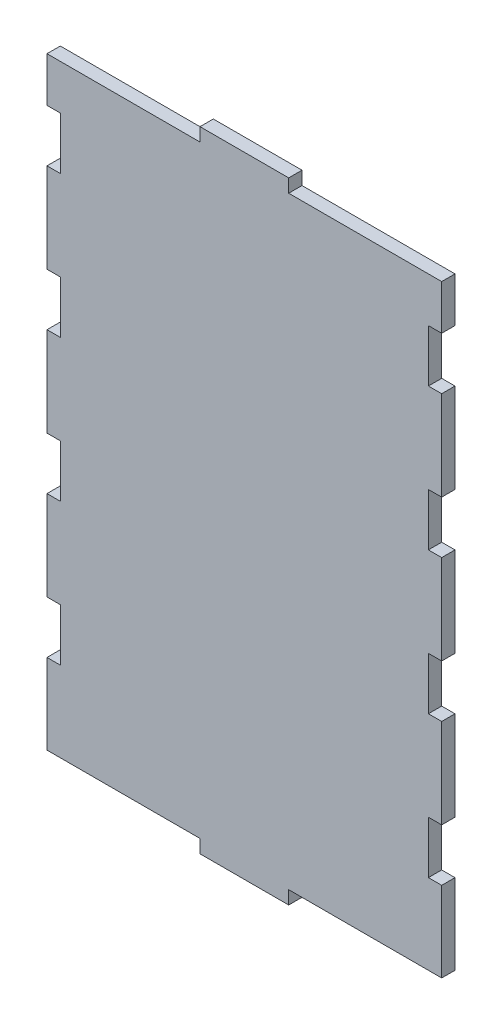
ISO-10303-21;
HEADER;
FILE_DESCRIPTION(('STEP AP214'),'2;1');
FILE_NAME('part.step','',(''),(''),'','','');
FILE_SCHEMA(('AUTOMOTIVE_DESIGN { 1 0 10303 214 1 1 1 1 }'));
ENDSEC;
DATA;
#1=APPLICATION_CONTEXT('core data for automotive mechanical design processes');
#2=APPLICATION_PROTOCOL_DEFINITION('international standard','automotive_design',2000,#1);
#3=PRODUCT_CONTEXT('',#1,'mechanical');
#4=PRODUCT('Part','Part','',(#3));
#5=PRODUCT_RELATED_PRODUCT_CATEGORY('part','',(#4));
#6=PRODUCT_DEFINITION_FORMATION('','',#4);
#7=PRODUCT_DEFINITION_CONTEXT('part definition',#1,'design');
#8=PRODUCT_DEFINITION('design','',#6,#7);
#9=PRODUCT_DEFINITION_SHAPE('','',#8);
#10=(LENGTH_UNIT() NAMED_UNIT(*) SI_UNIT(.MILLI.,.METRE.));
#11=(NAMED_UNIT(*) PLANE_ANGLE_UNIT() SI_UNIT($,.RADIAN.));
#12=(NAMED_UNIT(*) SI_UNIT($,.STERADIAN.) SOLID_ANGLE_UNIT());
#13=UNCERTAINTY_MEASURE_WITH_UNIT(LENGTH_MEASURE(1.E-05),#10,'distance_accuracy_value','');
#14=(GEOMETRIC_REPRESENTATION_CONTEXT(3) GLOBAL_UNCERTAINTY_ASSIGNED_CONTEXT((#13)) GLOBAL_UNIT_ASSIGNED_CONTEXT((#10,
#11,#12)) REPRESENTATION_CONTEXT('',''));
#15=CARTESIAN_POINT('',(0.,0.,0.));
#16=DIRECTION('',(0.,0.,1.));
#17=DIRECTION('',(1.,0.,0.));
#18=AXIS2_PLACEMENT_3D('',#15,#16,#17);
#19=CARTESIAN_POINT('',(-222.5,-355.,15.));
#20=DIRECTION('',(1.,0.,0.));
#21=DIRECTION('',(0.,0.,-1.));
#22=AXIS2_PLACEMENT_3D('',#19,#20,#21);
#23=PLANE('',#22);
#24=DIRECTION('',(0.,0.,1.));
#25=VECTOR('',#24,1.);
#26=CARTESIAN_POINT('',(-222.500000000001,289.5,0.));
#27=LINE('',#26,#25);
#28=CARTESIAN_POINT('',(-222.500000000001,289.5,0.));
#29=VERTEX_POINT('',#28);
#30=CARTESIAN_POINT('',(-222.500000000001,289.5,15.));
#31=VERTEX_POINT('',#30);
#32=EDGE_CURVE('E412',#29,#31,#27,.T.);
#33=ORIENTED_EDGE('',*,*,#32,.T.);
#34=DIRECTION('',(0.,-1.,0.));
#35=VECTOR('',#34,1.);
#36=CARTESIAN_POINT('',(-222.5,-355.,15.));
#37=LINE('',#36,#35);
#38=CARTESIAN_POINT('',(-222.5,340.,15.));
#39=VERTEX_POINT('',#38);
#40=EDGE_CURVE('E603',#39,#31,#37,.T.);
#41=ORIENTED_EDGE('',*,*,#40,.F.);
#42=DIRECTION('',(0.,0.,1.));
#43=VECTOR('',#42,1.);
#44=CARTESIAN_POINT('',(-222.5,340.,0.));
#45=LINE('',#44,#43);
#46=CARTESIAN_POINT('',(-222.5,340.,0.));
#47=VERTEX_POINT('',#46);
#48=EDGE_CURVE('E580',#47,#39,#45,.T.);
#49=ORIENTED_EDGE('',*,*,#48,.F.);
#50=DIRECTION('',(0.,-1.,0.));
#51=VECTOR('',#50,1.);
#52=CARTESIAN_POINT('',(-222.5,-355.,0.));
#53=LINE('',#52,#51);
#54=EDGE_CURVE('E614',#47,#29,#53,.T.);
#55=ORIENTED_EDGE('',*,*,#54,.T.);
#56=EDGE_LOOP('',(#33,#41,#49,#55));
#57=FACE_BOUND('',#56,.T.);
#58=ADVANCED_FACE('F33',(#57),#23,.F.);
#59=CARTESIAN_POINT('',(0.,0.,15.));
#60=DIRECTION('',(0.,0.,1.));
#61=DIRECTION('',(1.,0.,0.));
#62=AXIS2_PLACEMENT_3D('',#59,#60,#61);
#63=PLANE('',#62);
#64=DIRECTION('',(1.,0.,0.));
#65=VECTOR('',#64,1.);
#66=CARTESIAN_POINT('',(-222.500000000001,230.5,15.));
#67=LINE('',#66,#65);
#68=CARTESIAN_POINT('',(-222.500000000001,230.5,15.));
#69=VERTEX_POINT('',#68);
#70=CARTESIAN_POINT('',(-207.5,230.5,15.));
#71=VERTEX_POINT('',#70);
#72=EDGE_CURVE('E392',#69,#71,#67,.T.);
#73=ORIENTED_EDGE('',*,*,#72,.F.);
#74=CARTESIAN_POINT('',(-222.5,129.5,15.));
#75=VERTEX_POINT('',#74);
#76=EDGE_CURVE('E607',#69,#75,#37,.T.);
#77=ORIENTED_EDGE('',*,*,#76,.T.);
#78=DIRECTION('',(1.,0.,0.));
#79=VECTOR('',#78,1.);
#80=CARTESIAN_POINT('',(0.,129.5,15.));
#81=LINE('',#80,#79);
#82=CARTESIAN_POINT('',(-207.5,129.5,15.));
#83=VERTEX_POINT('',#82);
#84=EDGE_CURVE('E452',#75,#83,#81,.T.);
#85=ORIENTED_EDGE('',*,*,#84,.T.);
#86=DIRECTION('',(0.,-1.,0.));
#87=VECTOR('',#86,1.);
#88=CARTESIAN_POINT('',(-207.5,0.,15.));
#89=LINE('',#88,#87);
#90=CARTESIAN_POINT('',(-207.5,70.5,15.));
#91=VERTEX_POINT('',#90);
#92=EDGE_CURVE('E505',#83,#91,#89,.T.);
#93=ORIENTED_EDGE('',*,*,#92,.T.);
#94=DIRECTION('',(1.,0.,0.));
#95=VECTOR('',#94,1.);
#96=CARTESIAN_POINT('',(0.,70.5,15.));
#97=LINE('',#96,#95);
#98=CARTESIAN_POINT('',(-222.5,70.5,15.));
#99=VERTEX_POINT('',#98);
#100=EDGE_CURVE('E514',#99,#91,#97,.T.);
#101=ORIENTED_EDGE('',*,*,#100,.F.);
#102=CARTESIAN_POINT('',(-222.5,-30.5,15.));
#103=VERTEX_POINT('',#102);
#104=EDGE_CURVE('E608',#99,#103,#37,.T.);
#105=ORIENTED_EDGE('',*,*,#104,.T.);
#106=DIRECTION('',(1.,0.,0.));
#107=VECTOR('',#106,1.);
#108=CARTESIAN_POINT('',(0.,-30.5000000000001,15.));
#109=LINE('',#108,#107);
#110=CARTESIAN_POINT('',(-207.5,-30.5000000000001,15.));
#111=VERTEX_POINT('',#110);
#112=EDGE_CURVE('E445',#103,#111,#109,.T.);
#113=ORIENTED_EDGE('',*,*,#112,.T.);
#114=DIRECTION('',(0.,-1.,0.));
#115=VECTOR('',#114,1.);
#116=CARTESIAN_POINT('',(-207.5,0.,15.));
#117=LINE('',#116,#115);
#118=CARTESIAN_POINT('',(-207.5,-89.5000000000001,15.));
#119=VERTEX_POINT('',#118);
#120=EDGE_CURVE('E449',#111,#119,#117,.T.);
#121=ORIENTED_EDGE('',*,*,#120,.T.);
#122=DIRECTION('',(1.,0.,0.));
#123=VECTOR('',#122,1.);
#124=CARTESIAN_POINT('',(0.,-89.5000000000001,15.));
#125=LINE('',#124,#123);
#126=CARTESIAN_POINT('',(-222.5,-89.5000000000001,15.));
#127=VERTEX_POINT('',#126);
#128=EDGE_CURVE('E442',#127,#119,#125,.T.);
#129=ORIENTED_EDGE('',*,*,#128,.F.);
#130=CARTESIAN_POINT('',(-222.5,-190.5,15.));
#131=VERTEX_POINT('',#130);
#132=EDGE_CURVE('E714',#127,#131,#37,.T.);
#133=ORIENTED_EDGE('',*,*,#132,.T.);
#134=DIRECTION('',(1.,0.,0.));
#135=VECTOR('',#134,1.);
#136=CARTESIAN_POINT('',(0.,-190.5,15.));
#137=LINE('',#136,#135);
#138=CARTESIAN_POINT('',(-207.5,-190.5,15.));
#139=VERTEX_POINT('',#138);
#140=EDGE_CURVE('E58',#131,#139,#137,.T.);
#141=ORIENTED_EDGE('',*,*,#140,.T.);
#142=DIRECTION('',(0.,-1.,0.));
#143=VECTOR('',#142,1.);
#144=CARTESIAN_POINT('',(-207.5,0.,15.));
#145=LINE('',#144,#143);
#146=CARTESIAN_POINT('',(-207.5,-249.5,15.));
#147=VERTEX_POINT('',#146);
#148=EDGE_CURVE('E441',#139,#147,#145,.T.);
#149=ORIENTED_EDGE('',*,*,#148,.T.);
#150=DIRECTION('',(1.,0.,0.));
#151=VECTOR('',#150,1.);
#152=CARTESIAN_POINT('',(0.,-249.5,15.));
#153=LINE('',#152,#151);
#154=CARTESIAN_POINT('',(-222.5,-249.5,15.));
#155=VERTEX_POINT('',#154);
#156=EDGE_CURVE('E468',#155,#147,#153,.T.);
#157=ORIENTED_EDGE('',*,*,#156,.F.);
#158=CARTESIAN_POINT('',(-222.5,-340.,15.));
#159=VERTEX_POINT('',#158);
#160=EDGE_CURVE('E629',#155,#159,#37,.T.);
#161=ORIENTED_EDGE('',*,*,#160,.T.);
#162=DIRECTION('',(-1.,0.,0.));
#163=VECTOR('',#162,1.);
#164=CARTESIAN_POINT('',(-222.5,-340.,15.));
#165=LINE('',#164,#163);
#166=CARTESIAN_POINT('',(-50.,-340.,15.));
#167=VERTEX_POINT('',#166);
#168=EDGE_CURVE('E588',#167,#159,#165,.T.);
#169=ORIENTED_EDGE('',*,*,#168,.F.);
#170=DIRECTION('',(0.,1.,0.));
#171=VECTOR('',#170,1.);
#172=CARTESIAN_POINT('',(-50.,-340.,15.));
#173=LINE('',#172,#171);
#174=CARTESIAN_POINT('',(-50.,-355.,15.));
#175=VERTEX_POINT('',#174);
#176=EDGE_CURVE('E545',#175,#167,#173,.T.);
#177=ORIENTED_EDGE('',*,*,#176,.F.);
#178=DIRECTION('',(1.,0.,0.));
#179=VECTOR('',#178,1.);
#180=CARTESIAN_POINT('',(222.5,-355.,15.));
#181=LINE('',#180,#179);
#182=CARTESIAN_POINT('',(50.,-355.,15.));
#183=VERTEX_POINT('',#182);
#184=EDGE_CURVE('E606',#175,#183,#181,.T.);
#185=ORIENTED_EDGE('',*,*,#184,.T.);
#186=DIRECTION('',(0.,-1.,0.));
#187=VECTOR('',#186,1.);
#188=CARTESIAN_POINT('',(50.,-355.,15.));
#189=LINE('',#188,#187);
#190=CARTESIAN_POINT('',(50.,-340.,15.));
#191=VERTEX_POINT('',#190);
#192=EDGE_CURVE('E533',#191,#183,#189,.T.);
#193=ORIENTED_EDGE('',*,*,#192,.F.);
#194=DIRECTION('',(-1.,0.,0.));
#195=VECTOR('',#194,1.);
#196=CARTESIAN_POINT('',(50.,-340.,15.));
#197=LINE('',#196,#195);
#198=CARTESIAN_POINT('',(222.5,-340.,15.));
#199=VERTEX_POINT('',#198);
#200=EDGE_CURVE('E537',#199,#191,#197,.T.);
#201=ORIENTED_EDGE('',*,*,#200,.F.);
#202=DIRECTION('',(0.,1.,0.));
#203=VECTOR('',#202,1.);
#204=CARTESIAN_POINT('',(222.5,-355.,15.));
#205=LINE('',#204,#203);
#206=CARTESIAN_POINT('',(222.5,-249.5,15.));
#207=VERTEX_POINT('',#206);
#208=EDGE_CURVE('E42',#199,#207,#205,.T.);
#209=ORIENTED_EDGE('',*,*,#208,.T.);
#210=DIRECTION('',(-1.,0.,0.));
#211=VECTOR('',#210,1.);
#212=CARTESIAN_POINT('',(0.,-249.5,15.));
#213=LINE('',#212,#211);
#214=CARTESIAN_POINT('',(207.5,-249.5,15.));
#215=VERTEX_POINT('',#214);
#216=EDGE_CURVE('E467',#207,#215,#213,.T.);
#217=ORIENTED_EDGE('',*,*,#216,.T.);
#218=DIRECTION('',(0.,-1.,0.));
#219=VECTOR('',#218,1.);
#220=CARTESIAN_POINT('',(207.5,0.,15.));
#221=LINE('',#220,#219);
#222=CARTESIAN_POINT('',(207.5,-190.5,15.));
#223=VERTEX_POINT('',#222);
#224=EDGE_CURVE('E487',#223,#215,#221,.T.);
#225=ORIENTED_EDGE('',*,*,#224,.F.);
#226=DIRECTION('',(-1.,0.,0.));
#227=VECTOR('',#226,1.);
#228=CARTESIAN_POINT('',(0.,-190.5,15.));
#229=LINE('',#228,#227);
#230=CARTESIAN_POINT('',(222.5,-190.5,15.));
#231=VERTEX_POINT('',#230);
#232=EDGE_CURVE('E490',#231,#223,#229,.T.);
#233=ORIENTED_EDGE('',*,*,#232,.F.);
#234=CARTESIAN_POINT('',(222.5,-89.4999999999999,15.));
#235=VERTEX_POINT('',#234);
#236=EDGE_CURVE('E342',#231,#235,#205,.T.);
#237=ORIENTED_EDGE('',*,*,#236,.T.);
#238=DIRECTION('',(-1.,0.,0.));
#239=VECTOR('',#238,1.);
#240=CARTESIAN_POINT('',(0.,-89.4999999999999,15.));
#241=LINE('',#240,#239);
#242=CARTESIAN_POINT('',(207.5,-89.4999999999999,15.));
#243=VERTEX_POINT('',#242);
#244=EDGE_CURVE('E319',#235,#243,#241,.T.);
#245=ORIENTED_EDGE('',*,*,#244,.T.);
#246=DIRECTION('',(0.,-1.,0.));
#247=VECTOR('',#246,1.);
#248=CARTESIAN_POINT('',(207.5,0.,15.));
#249=LINE('',#248,#247);
#250=CARTESIAN_POINT('',(207.5,-30.4999999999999,15.));
#251=VERTEX_POINT('',#250);
#252=EDGE_CURVE('E330',#251,#243,#249,.T.);
#253=ORIENTED_EDGE('',*,*,#252,.F.);
#254=DIRECTION('',(-1.,0.,0.));
#255=VECTOR('',#254,1.);
#256=CARTESIAN_POINT('',(0.,-30.4999999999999,15.));
#257=LINE('',#256,#255);
#258=CARTESIAN_POINT('',(222.5,-30.4999999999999,15.));
#259=VERTEX_POINT('',#258);
#260=EDGE_CURVE('E335',#259,#251,#257,.T.);
#261=ORIENTED_EDGE('',*,*,#260,.F.);
#262=CARTESIAN_POINT('',(222.5,70.5000000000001,15.));
#263=VERTEX_POINT('',#262);
#264=EDGE_CURVE('E661',#259,#263,#205,.T.);
#265=ORIENTED_EDGE('',*,*,#264,.T.);
#266=DIRECTION('',(-1.,0.,0.));
#267=VECTOR('',#266,1.);
#268=CARTESIAN_POINT('',(0.,70.5000000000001,15.));
#269=LINE('',#268,#267);
#270=CARTESIAN_POINT('',(207.5,70.5000000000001,15.));
#271=VERTEX_POINT('',#270);
#272=EDGE_CURVE('E367',#263,#271,#269,.T.);
#273=ORIENTED_EDGE('',*,*,#272,.T.);
#274=DIRECTION('',(0.,-1.,0.));
#275=VECTOR('',#274,1.);
#276=CARTESIAN_POINT('',(207.5,1.95229896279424E-13,15.));
#277=LINE('',#276,#275);
#278=CARTESIAN_POINT('',(207.5,129.5,15.));
#279=VERTEX_POINT('',#278);
#280=EDGE_CURVE('E370',#279,#271,#277,.T.);
#281=ORIENTED_EDGE('',*,*,#280,.F.);
#282=DIRECTION('',(-1.,0.,0.));
#283=VECTOR('',#282,1.);
#284=CARTESIAN_POINT('',(0.,129.5,15.));
#285=LINE('',#284,#283);
#286=CARTESIAN_POINT('',(222.5,129.5,15.));
#287=VERTEX_POINT('',#286);
#288=EDGE_CURVE('E327',#287,#279,#285,.T.);
#289=ORIENTED_EDGE('',*,*,#288,.F.);
#290=CARTESIAN_POINT('',(222.5,230.5,15.));
#291=VERTEX_POINT('',#290);
#292=EDGE_CURVE('E662',#287,#291,#205,.T.);
#293=ORIENTED_EDGE('',*,*,#292,.T.);
#294=DIRECTION('',(-1.,0.,0.));
#295=VECTOR('',#294,1.);
#296=CARTESIAN_POINT('',(0.,230.5,15.));
#297=LINE('',#296,#295);
#298=CARTESIAN_POINT('',(207.5,230.5,15.));
#299=VERTEX_POINT('',#298);
#300=EDGE_CURVE('E393',#291,#299,#297,.T.);
#301=ORIENTED_EDGE('',*,*,#300,.T.);
#302=DIRECTION('',(0.,-1.,0.));
#303=VECTOR('',#302,1.);
#304=CARTESIAN_POINT('',(207.5,1.95229896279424E-13,15.));
#305=LINE('',#304,#303);
#306=CARTESIAN_POINT('',(207.5,289.5,15.));
#307=VERTEX_POINT('',#306);
#308=EDGE_CURVE('E396',#307,#299,#305,.T.);
#309=ORIENTED_EDGE('',*,*,#308,.F.);
#310=DIRECTION('',(-1.,0.,0.));
#311=VECTOR('',#310,1.);
#312=CARTESIAN_POINT('',(0.,289.5,15.));
#313=LINE('',#312,#311);
#314=CARTESIAN_POINT('',(222.5,289.5,15.));
#315=VERTEX_POINT('',#314);
#316=EDGE_CURVE('E366',#315,#307,#313,.T.);
#317=ORIENTED_EDGE('',*,*,#316,.F.);
#318=CARTESIAN_POINT('',(222.5,340.,15.));
#319=VERTEX_POINT('',#318);
#320=EDGE_CURVE('E611',#315,#319,#205,.T.);
#321=ORIENTED_EDGE('',*,*,#320,.T.);
#322=DIRECTION('',(1.,0.,0.));
#323=VECTOR('',#322,1.);
#324=CARTESIAN_POINT('',(50.,340.,15.));
#325=LINE('',#324,#323);
#326=CARTESIAN_POINT('',(50.,340.,15.));
#327=VERTEX_POINT('',#326);
#328=EDGE_CURVE('E553',#327,#319,#325,.T.);
#329=ORIENTED_EDGE('',*,*,#328,.F.);
#330=DIRECTION('',(0.,-1.,0.));
#331=VECTOR('',#330,1.);
#332=CARTESIAN_POINT('',(50.,355.,15.));
#333=LINE('',#332,#331);
#334=CARTESIAN_POINT('',(50.,355.,15.));
#335=VERTEX_POINT('',#334);
#336=EDGE_CURVE('E557',#335,#327,#333,.T.);
#337=ORIENTED_EDGE('',*,*,#336,.F.);
#338=DIRECTION('',(-1.,0.,0.));
#339=VECTOR('',#338,1.);
#340=CARTESIAN_POINT('',(222.5,355.,15.));
#341=LINE('',#340,#339);
#342=CARTESIAN_POINT('',(-50.,355.,15.));
#343=VERTEX_POINT('',#342);
#344=EDGE_CURVE('E11',#335,#343,#341,.T.);
#345=ORIENTED_EDGE('',*,*,#344,.T.);
#346=DIRECTION('',(0.,1.,0.));
#347=VECTOR('',#346,1.);
#348=CARTESIAN_POINT('',(-50.,340.,15.));
#349=LINE('',#348,#347);
#350=CARTESIAN_POINT('',(-50.,340.,15.));
#351=VERTEX_POINT('',#350);
#352=EDGE_CURVE('E522',#351,#343,#349,.T.);
#353=ORIENTED_EDGE('',*,*,#352,.F.);
#354=DIRECTION('',(1.,0.,0.));
#355=VECTOR('',#354,1.);
#356=CARTESIAN_POINT('',(-222.5,340.,15.));
#357=LINE('',#356,#355);
#358=EDGE_CURVE('E572',#39,#351,#357,.T.);
#359=ORIENTED_EDGE('',*,*,#358,.F.);
#360=ORIENTED_EDGE('',*,*,#40,.T.);
#361=DIRECTION('',(1.,0.,0.));
#362=VECTOR('',#361,1.);
#363=CARTESIAN_POINT('',(-222.500000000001,289.5,15.));
#364=LINE('',#363,#362);
#365=CARTESIAN_POINT('',(-207.5,289.5,15.));
#366=VERTEX_POINT('',#365);
#367=EDGE_CURVE('E417',#31,#366,#364,.T.);
#368=ORIENTED_EDGE('',*,*,#367,.T.);
#369=DIRECTION('',(0.,-1.,0.));
#370=VECTOR('',#369,1.);
#371=CARTESIAN_POINT('',(-207.5,289.5,15.));
#372=LINE('',#371,#370);
#373=EDGE_CURVE('E420',#366,#71,#372,.T.);
#374=ORIENTED_EDGE('',*,*,#373,.T.);
#375=EDGE_LOOP('',(#73,#77,#85,#93,#101,#105,#113,#121,#129,#133,#141,#149,#157,#161,#169,#177,
#185,#193,#201,#209,#217,#225,#233,#237,#245,#253,#261,#265,#273,#281,#289,#293,#301,#309,#317,
#321,#329,#337,#345,#353,#359,#360,#368,#374));
#376=FACE_BOUND('',#375,.T.);
#377=ADVANCED_FACE('F339',(#376),#63,.T.);
#378=CARTESIAN_POINT('',(0.,0.,0.));
#379=DIRECTION('',(0.,0.,1.));
#380=DIRECTION('',(1.,0.,0.));
#381=AXIS2_PLACEMENT_3D('',#378,#379,#380);
#382=PLANE('',#381);
#383=CARTESIAN_POINT('',(-222.500000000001,230.5,0.));
#384=VERTEX_POINT('',#383);
#385=CARTESIAN_POINT('',(-222.5,129.5,0.));
#386=VERTEX_POINT('',#385);
#387=EDGE_CURVE('E618',#384,#386,#53,.T.);
#388=ORIENTED_EDGE('',*,*,#387,.F.);
#389=DIRECTION('',(1.,0.,0.));
#390=VECTOR('',#389,1.);
#391=CARTESIAN_POINT('',(-222.500000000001,230.5,0.));
#392=LINE('',#391,#390);
#393=CARTESIAN_POINT('',(-207.5,230.5,0.));
#394=VERTEX_POINT('',#393);
#395=EDGE_CURVE('E421',#384,#394,#392,.T.);
#396=ORIENTED_EDGE('',*,*,#395,.T.);
#397=DIRECTION('',(0.,-1.,0.));
#398=VECTOR('',#397,1.);
#399=CARTESIAN_POINT('',(-207.5,289.5,0.));
#400=LINE('',#399,#398);
#401=CARTESIAN_POINT('',(-207.5,289.5,0.));
#402=VERTEX_POINT('',#401);
#403=EDGE_CURVE('E427',#402,#394,#400,.T.);
#404=ORIENTED_EDGE('',*,*,#403,.F.);
#405=DIRECTION('',(1.,0.,0.));
#406=VECTOR('',#405,1.);
#407=CARTESIAN_POINT('',(-222.500000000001,289.5,0.));
#408=LINE('',#407,#406);
#409=EDGE_CURVE('E410',#29,#402,#408,.T.);
#410=ORIENTED_EDGE('',*,*,#409,.F.);
#411=ORIENTED_EDGE('',*,*,#54,.F.);
#412=DIRECTION('',(1.,0.,0.));
#413=VECTOR('',#412,1.);
#414=CARTESIAN_POINT('',(-222.5,340.,0.));
#415=LINE('',#414,#413);
#416=CARTESIAN_POINT('',(-50.,340.,0.));
#417=VERTEX_POINT('',#416);
#418=EDGE_CURVE('E571',#47,#417,#415,.T.);
#419=ORIENTED_EDGE('',*,*,#418,.T.);
#420=DIRECTION('',(0.,1.,0.));
#421=VECTOR('',#420,1.);
#422=CARTESIAN_POINT('',(-50.,340.,0.));
#423=LINE('',#422,#421);
#424=CARTESIAN_POINT('',(-50.,355.,0.));
#425=VERTEX_POINT('',#424);
#426=EDGE_CURVE('E568',#417,#425,#423,.T.);
#427=ORIENTED_EDGE('',*,*,#426,.T.);
#428=DIRECTION('',(-1.,0.,0.));
#429=VECTOR('',#428,1.);
#430=CARTESIAN_POINT('',(222.5,355.,0.));
#431=LINE('',#430,#429);
#432=CARTESIAN_POINT('',(50.,355.,0.));
#433=VERTEX_POINT('',#432);
#434=EDGE_CURVE('E37',#433,#425,#431,.T.);
#435=ORIENTED_EDGE('',*,*,#434,.F.);
#436=DIRECTION('',(0.,-1.,0.));
#437=VECTOR('',#436,1.);
#438=CARTESIAN_POINT('',(50.,355.,0.));
#439=LINE('',#438,#437);
#440=CARTESIAN_POINT('',(50.,340.,0.));
#441=VERTEX_POINT('',#440);
#442=EDGE_CURVE('E549',#433,#441,#439,.T.);
#443=ORIENTED_EDGE('',*,*,#442,.T.);
#444=DIRECTION('',(1.,0.,0.));
#445=VECTOR('',#444,1.);
#446=CARTESIAN_POINT('',(50.,340.,0.));
#447=LINE('',#446,#445);
#448=CARTESIAN_POINT('',(222.5,340.,0.));
#449=VERTEX_POINT('',#448);
#450=EDGE_CURVE('E552',#441,#449,#447,.T.);
#451=ORIENTED_EDGE('',*,*,#450,.T.);
#452=DIRECTION('',(0.,1.,0.));
#453=VECTOR('',#452,1.);
#454=CARTESIAN_POINT('',(222.5,-355.,0.));
#455=LINE('',#454,#453);
#456=CARTESIAN_POINT('',(222.5,289.5,0.));
#457=VERTEX_POINT('',#456);
#458=EDGE_CURVE('E621',#457,#449,#455,.T.);
#459=ORIENTED_EDGE('',*,*,#458,.F.);
#460=DIRECTION('',(-1.,0.,0.));
#461=VECTOR('',#460,1.);
#462=CARTESIAN_POINT('',(0.,289.5,0.));
#463=LINE('',#462,#461);
#464=CARTESIAN_POINT('',(207.5,289.5,0.));
#465=VERTEX_POINT('',#464);
#466=EDGE_CURVE('E397',#457,#465,#463,.T.);
#467=ORIENTED_EDGE('',*,*,#466,.T.);
#468=DIRECTION('',(0.,-1.,0.));
#469=VECTOR('',#468,1.);
#470=CARTESIAN_POINT('',(207.5,1.95229896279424E-13,0.));
#471=LINE('',#470,#469);
#472=CARTESIAN_POINT('',(207.5,230.5,0.));
#473=VERTEX_POINT('',#472);
#474=EDGE_CURVE('E403',#465,#473,#471,.T.);
#475=ORIENTED_EDGE('',*,*,#474,.T.);
#476=DIRECTION('',(-1.,0.,0.));
#477=VECTOR('',#476,1.);
#478=CARTESIAN_POINT('',(0.,230.5,0.));
#479=LINE('',#478,#477);
#480=CARTESIAN_POINT('',(222.5,230.5,0.));
#481=VERTEX_POINT('',#480);
#482=EDGE_CURVE('E384',#481,#473,#479,.T.);
#483=ORIENTED_EDGE('',*,*,#482,.F.);
#484=CARTESIAN_POINT('',(222.5,129.5,0.));
#485=VERTEX_POINT('',#484);
#486=EDGE_CURVE('E632',#485,#481,#455,.T.);
#487=ORIENTED_EDGE('',*,*,#486,.F.);
#488=DIRECTION('',(-1.,0.,0.));
#489=VECTOR('',#488,1.);
#490=CARTESIAN_POINT('',(0.,129.5,0.));
#491=LINE('',#490,#489);
#492=CARTESIAN_POINT('',(207.5,129.5,0.));
#493=VERTEX_POINT('',#492);
#494=EDGE_CURVE('E371',#485,#493,#491,.T.);
#495=ORIENTED_EDGE('',*,*,#494,.T.);
#496=DIRECTION('',(0.,-1.,0.));
#497=VECTOR('',#496,1.);
#498=CARTESIAN_POINT('',(207.5,1.95229896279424E-13,0.));
#499=LINE('',#498,#497);
#500=CARTESIAN_POINT('',(207.5,70.5000000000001,0.));
#501=VERTEX_POINT('',#500);
#502=EDGE_CURVE('E377',#493,#501,#499,.T.);
#503=ORIENTED_EDGE('',*,*,#502,.T.);
#504=DIRECTION('',(-1.,0.,0.));
#505=VECTOR('',#504,1.);
#506=CARTESIAN_POINT('',(0.,70.5000000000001,0.));
#507=LINE('',#506,#505);
#508=CARTESIAN_POINT('',(222.5,70.5000000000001,0.));
#509=VERTEX_POINT('',#508);
#510=EDGE_CURVE('E358',#509,#501,#507,.T.);
#511=ORIENTED_EDGE('',*,*,#510,.F.);
#512=CARTESIAN_POINT('',(222.5,-30.4999999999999,0.));
#513=VERTEX_POINT('',#512);
#514=EDGE_CURVE('E631',#513,#509,#455,.T.);
#515=ORIENTED_EDGE('',*,*,#514,.F.);
#516=DIRECTION('',(-1.,0.,0.));
#517=VECTOR('',#516,1.);
#518=CARTESIAN_POINT('',(0.,-30.4999999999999,0.));
#519=LINE('',#518,#517);
#520=CARTESIAN_POINT('',(207.5,-30.4999999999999,0.));
#521=VERTEX_POINT('',#520);
#522=EDGE_CURVE('E351',#513,#521,#519,.T.);
#523=ORIENTED_EDGE('',*,*,#522,.T.);
#524=DIRECTION('',(0.,-1.,0.));
#525=VECTOR('',#524,1.);
#526=CARTESIAN_POINT('',(207.5,0.,0.));
#527=LINE('',#526,#525);
#528=CARTESIAN_POINT('',(207.5,-89.4999999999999,0.));
#529=VERTEX_POINT('',#528);
#530=EDGE_CURVE('E349',#521,#529,#527,.T.);
#531=ORIENTED_EDGE('',*,*,#530,.T.);
#532=DIRECTION('',(-1.,0.,0.));
#533=VECTOR('',#532,1.);
#534=CARTESIAN_POINT('',(0.,-89.4999999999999,0.));
#535=LINE('',#534,#533);
#536=CARTESIAN_POINT('',(222.5,-89.4999999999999,0.));
#537=VERTEX_POINT('',#536);
#538=EDGE_CURVE('E322',#537,#529,#535,.T.);
#539=ORIENTED_EDGE('',*,*,#538,.F.);
#540=CARTESIAN_POINT('',(222.5,-190.5,0.));
#541=VERTEX_POINT('',#540);
#542=EDGE_CURVE('E624',#541,#537,#455,.T.);
#543=ORIENTED_EDGE('',*,*,#542,.F.);
#544=DIRECTION('',(-1.,0.,0.));
#545=VECTOR('',#544,1.);
#546=CARTESIAN_POINT('',(0.,-190.5,0.));
#547=LINE('',#546,#545);
#548=CARTESIAN_POINT('',(207.5,-190.5,0.));
#549=VERTEX_POINT('',#548);
#550=EDGE_CURVE('E498',#541,#549,#547,.T.);
#551=ORIENTED_EDGE('',*,*,#550,.T.);
#552=DIRECTION('',(0.,-1.,0.));
#553=VECTOR('',#552,1.);
#554=CARTESIAN_POINT('',(207.5,0.,0.));
#555=LINE('',#554,#553);
#556=CARTESIAN_POINT('',(207.5,-249.5,0.));
#557=VERTEX_POINT('',#556);
#558=EDGE_CURVE('E483',#549,#557,#555,.T.);
#559=ORIENTED_EDGE('',*,*,#558,.T.);
#560=DIRECTION('',(-1.,0.,0.));
#561=VECTOR('',#560,1.);
#562=CARTESIAN_POINT('',(0.,-249.5,0.));
#563=LINE('',#562,#561);
#564=CARTESIAN_POINT('',(222.5,-249.5,0.));
#565=VERTEX_POINT('',#564);
#566=EDGE_CURVE('E491',#565,#557,#563,.T.);
#567=ORIENTED_EDGE('',*,*,#566,.F.);
#568=CARTESIAN_POINT('',(222.5,-340.,0.));
#569=VERTEX_POINT('',#568);
#570=EDGE_CURVE('E622',#569,#565,#455,.T.);
#571=ORIENTED_EDGE('',*,*,#570,.F.);
#572=DIRECTION('',(-1.,0.,0.));
#573=VECTOR('',#572,1.);
#574=CARTESIAN_POINT('',(50.,-340.,0.));
#575=LINE('',#574,#573);
#576=CARTESIAN_POINT('',(50.,-340.,0.));
#577=VERTEX_POINT('',#576);
#578=EDGE_CURVE('E529',#569,#577,#575,.T.);
#579=ORIENTED_EDGE('',*,*,#578,.T.);
#580=DIRECTION('',(0.,-1.,0.));
#581=VECTOR('',#580,1.);
#582=CARTESIAN_POINT('',(50.,-355.,0.));
#583=LINE('',#582,#581);
#584=CARTESIAN_POINT('',(50.,-355.,0.));
#585=VERTEX_POINT('',#584);
#586=EDGE_CURVE('E532',#577,#585,#583,.T.);
#587=ORIENTED_EDGE('',*,*,#586,.T.);
#588=DIRECTION('',(1.,0.,0.));
#589=VECTOR('',#588,1.);
#590=CARTESIAN_POINT('',(222.5,-355.,0.));
#591=LINE('',#590,#589);
#592=CARTESIAN_POINT('',(-50.,-355.,0.));
#593=VERTEX_POINT('',#592);
#594=EDGE_CURVE('E617',#593,#585,#591,.T.);
#595=ORIENTED_EDGE('',*,*,#594,.F.);
#596=DIRECTION('',(0.,1.,0.));
#597=VECTOR('',#596,1.);
#598=CARTESIAN_POINT('',(-50.,-340.,0.));
#599=LINE('',#598,#597);
#600=CARTESIAN_POINT('',(-50.,-340.,0.));
#601=VERTEX_POINT('',#600);
#602=EDGE_CURVE('E584',#593,#601,#599,.T.);
#603=ORIENTED_EDGE('',*,*,#602,.T.);
#604=DIRECTION('',(-1.,0.,0.));
#605=VECTOR('',#604,1.);
#606=CARTESIAN_POINT('',(-222.5,-340.,0.));
#607=LINE('',#606,#605);
#608=CARTESIAN_POINT('',(-222.5,-340.,0.));
#609=VERTEX_POINT('',#608);
#610=EDGE_CURVE('E587',#601,#609,#607,.T.);
#611=ORIENTED_EDGE('',*,*,#610,.T.);
#612=CARTESIAN_POINT('',(-222.5,-249.5,0.));
#613=VERTEX_POINT('',#612);
#614=EDGE_CURVE('E599',#613,#609,#53,.T.);
#615=ORIENTED_EDGE('',*,*,#614,.F.);
#616=DIRECTION('',(1.,0.,0.));
#617=VECTOR('',#616,1.);
#618=CARTESIAN_POINT('',(0.,-249.5,0.));
#619=LINE('',#618,#617);
#620=CARTESIAN_POINT('',(-207.5,-249.5,0.));
#621=VERTEX_POINT('',#620);
#622=EDGE_CURVE('E460',#613,#621,#619,.T.);
#623=ORIENTED_EDGE('',*,*,#622,.T.);
#624=DIRECTION('',(0.,-1.,0.));
#625=VECTOR('',#624,1.);
#626=CARTESIAN_POINT('',(-207.5,0.,0.));
#627=LINE('',#626,#625);
#628=CARTESIAN_POINT('',(-207.5,-190.5,0.));
#629=VERTEX_POINT('',#628);
#630=EDGE_CURVE('E471',#629,#621,#627,.T.);
#631=ORIENTED_EDGE('',*,*,#630,.F.);
#632=DIRECTION('',(1.,0.,0.));
#633=VECTOR('',#632,1.);
#634=CARTESIAN_POINT('',(0.,-190.5,0.));
#635=LINE('',#634,#633);
#636=CARTESIAN_POINT('',(-222.5,-190.5,0.));
#637=VERTEX_POINT('',#636);
#638=EDGE_CURVE('E477',#637,#629,#635,.T.);
#639=ORIENTED_EDGE('',*,*,#638,.F.);
#640=CARTESIAN_POINT('',(-222.5,-89.5000000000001,0.));
#641=VERTEX_POINT('',#640);
#642=EDGE_CURVE('E741',#641,#637,#53,.T.);
#643=ORIENTED_EDGE('',*,*,#642,.F.);
#644=DIRECTION('',(1.,0.,0.));
#645=VECTOR('',#644,1.);
#646=CARTESIAN_POINT('',(0.,-89.5000000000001,0.));
#647=LINE('',#646,#645);
#648=CARTESIAN_POINT('',(-207.5,-89.5000000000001,0.));
#649=VERTEX_POINT('',#648);
#650=EDGE_CURVE('E433',#641,#649,#647,.T.);
#651=ORIENTED_EDGE('',*,*,#650,.T.);
#652=DIRECTION('',(0.,-1.,0.));
#653=VECTOR('',#652,1.);
#654=CARTESIAN_POINT('',(-207.5,0.,0.));
#655=LINE('',#654,#653);
#656=CARTESIAN_POINT('',(-207.5,-30.5000000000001,0.));
#657=VERTEX_POINT('',#656);
#658=EDGE_CURVE('E446',#657,#649,#655,.T.);
#659=ORIENTED_EDGE('',*,*,#658,.F.);
#660=DIRECTION('',(1.,0.,0.));
#661=VECTOR('',#660,1.);
#662=CARTESIAN_POINT('',(0.,-30.5000000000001,0.));
#663=LINE('',#662,#661);
#664=CARTESIAN_POINT('',(-222.5,-30.5000000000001,0.));
#665=VERTEX_POINT('',#664);
#666=EDGE_CURVE('E455',#665,#657,#663,.T.);
#667=ORIENTED_EDGE('',*,*,#666,.F.);
#668=CARTESIAN_POINT('',(-222.5,70.5,0.));
#669=VERTEX_POINT('',#668);
#670=EDGE_CURVE('E619',#669,#665,#53,.T.);
#671=ORIENTED_EDGE('',*,*,#670,.F.);
#672=DIRECTION('',(1.,0.,0.));
#673=VECTOR('',#672,1.);
#674=CARTESIAN_POINT('',(0.,70.5,0.));
#675=LINE('',#674,#673);
#676=CARTESIAN_POINT('',(-207.5,70.5,0.));
#677=VERTEX_POINT('',#676);
#678=EDGE_CURVE('E504',#669,#677,#675,.T.);
#679=ORIENTED_EDGE('',*,*,#678,.T.);
#680=DIRECTION('',(0.,-1.,0.));
#681=VECTOR('',#680,1.);
#682=CARTESIAN_POINT('',(-207.5,0.,0.));
#683=LINE('',#682,#681);
#684=CARTESIAN_POINT('',(-207.5,129.5,0.));
#685=VERTEX_POINT('',#684);
#686=EDGE_CURVE('E508',#685,#677,#683,.T.);
#687=ORIENTED_EDGE('',*,*,#686,.F.);
#688=DIRECTION('',(1.,0.,0.));
#689=VECTOR('',#688,1.);
#690=CARTESIAN_POINT('',(0.,129.5,0.));
#691=LINE('',#690,#689);
#692=EDGE_CURVE('E502',#386,#685,#691,.T.);
#693=ORIENTED_EDGE('',*,*,#692,.F.);
#694=EDGE_LOOP('',(#388,#396,#404,#410,#411,#419,#427,#435,#443,#451,#459,#467,#475,#483,#487,
#495,#503,#511,#515,#523,#531,#539,#543,#551,#559,#567,#571,#579,#587,#595,#603,#611,#615,#623,
#631,#639,#643,#651,#659,#667,#671,#679,#687,#693));
#695=FACE_BOUND('',#694,.T.);
#696=ADVANCED_FACE('F652',(#695),#382,.F.);
#697=DIRECTION('',(0.,0.,1.));
#698=VECTOR('',#697,1.);
#699=CARTESIAN_POINT('',(-222.5,-190.5,0.));
#700=LINE('',#699,#698);
#701=EDGE_CURVE('E461',#637,#131,#700,.T.);
#702=ORIENTED_EDGE('',*,*,#701,.T.);
#703=ORIENTED_EDGE('',*,*,#132,.F.);
#704=DIRECTION('',(0.,0.,1.));
#705=VECTOR('',#704,1.);
#706=CARTESIAN_POINT('',(-222.5,-89.5000000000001,0.));
#707=LINE('',#706,#705);
#708=EDGE_CURVE('E437',#641,#127,#707,.T.);
#709=ORIENTED_EDGE('',*,*,#708,.F.);
#710=ORIENTED_EDGE('',*,*,#642,.T.);
#711=EDGE_LOOP('',(#702,#703,#709,#710));
#712=FACE_BOUND('',#711,.T.);
#713=ADVANCED_FACE('F695',(#712),#23,.F.);
#714=DIRECTION('',(0.,0.,1.));
#715=VECTOR('',#714,1.);
#716=CARTESIAN_POINT('',(-222.5,-30.5000000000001,0.));
#717=LINE('',#716,#715);
#718=EDGE_CURVE('E434',#665,#103,#717,.T.);
#719=ORIENTED_EDGE('',*,*,#718,.T.);
#720=ORIENTED_EDGE('',*,*,#104,.F.);
#721=DIRECTION('',(0.,0.,1.));
#722=VECTOR('',#721,1.);
#723=CARTESIAN_POINT('',(-222.5,70.5,0.));
#724=LINE('',#723,#722);
#725=EDGE_CURVE('E525',#669,#99,#724,.T.);
#726=ORIENTED_EDGE('',*,*,#725,.F.);
#727=ORIENTED_EDGE('',*,*,#670,.T.);
#728=EDGE_LOOP('',(#719,#720,#726,#727));
#729=FACE_BOUND('',#728,.T.);
#730=ADVANCED_FACE('F689',(#729),#23,.F.);
#731=CARTESIAN_POINT('',(222.5,-355.,15.));
#732=DIRECTION('',(-1.,0.,0.));
#733=DIRECTION('',(0.,0.,1.));
#734=AXIS2_PLACEMENT_3D('',#731,#732,#733);
#735=PLANE('',#734);
#736=DIRECTION('',(0.,0.,1.));
#737=VECTOR('',#736,1.);
#738=CARTESIAN_POINT('',(222.5,230.5,0.));
#739=LINE('',#738,#737);
#740=EDGE_CURVE('E387',#481,#291,#739,.T.);
#741=ORIENTED_EDGE('',*,*,#740,.T.);
#742=ORIENTED_EDGE('',*,*,#292,.F.);
#743=DIRECTION('',(0.,0.,1.));
#744=VECTOR('',#743,1.);
#745=CARTESIAN_POINT('',(222.5,129.5,0.));
#746=LINE('',#745,#744);
#747=EDGE_CURVE('E364',#485,#287,#746,.T.);
#748=ORIENTED_EDGE('',*,*,#747,.F.);
#749=ORIENTED_EDGE('',*,*,#486,.T.);
#750=EDGE_LOOP('',(#741,#742,#748,#749));
#751=FACE_BOUND('',#750,.T.);
#752=ADVANCED_FACE('F678',(#751),#735,.F.);
#753=DIRECTION('',(0.,0.,1.));
#754=VECTOR('',#753,1.);
#755=CARTESIAN_POINT('',(222.5,70.5000000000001,0.));
#756=LINE('',#755,#754);
#757=EDGE_CURVE('E361',#509,#263,#756,.T.);
#758=ORIENTED_EDGE('',*,*,#757,.T.);
#759=ORIENTED_EDGE('',*,*,#264,.F.);
#760=DIRECTION('',(0.,0.,1.));
#761=VECTOR('',#760,1.);
#762=CARTESIAN_POINT('',(222.5,-30.4999999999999,0.));
#763=LINE('',#762,#761);
#764=EDGE_CURVE('E648',#513,#259,#763,.T.);
#765=ORIENTED_EDGE('',*,*,#764,.F.);
#766=ORIENTED_EDGE('',*,*,#514,.T.);
#767=EDGE_LOOP('',(#758,#759,#765,#766));
#768=FACE_BOUND('',#767,.T.);
#769=ADVANCED_FACE('F645',(#768),#735,.F.);
#770=DIRECTION('',(0.,0.,1.));
#771=VECTOR('',#770,1.);
#772=CARTESIAN_POINT('',(222.5,-89.4999999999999,0.));
#773=LINE('',#772,#771);
#774=EDGE_CURVE('E352',#537,#235,#773,.T.);
#775=ORIENTED_EDGE('',*,*,#774,.T.);
#776=ORIENTED_EDGE('',*,*,#236,.F.);
#777=DIRECTION('',(0.,0.,1.));
#778=VECTOR('',#777,1.);
#779=CARTESIAN_POINT('',(222.5,-190.5,0.));
#780=LINE('',#779,#778);
#781=EDGE_CURVE('E484',#541,#231,#780,.T.);
#782=ORIENTED_EDGE('',*,*,#781,.F.);
#783=ORIENTED_EDGE('',*,*,#542,.T.);
#784=EDGE_LOOP('',(#775,#776,#782,#783));
#785=FACE_BOUND('',#784,.T.);
#786=ADVANCED_FACE('F692',(#785),#735,.F.);
#787=DIRECTION('',(0.,0.,1.));
#788=VECTOR('',#787,1.);
#789=CARTESIAN_POINT('',(222.5,-249.5,0.));
#790=LINE('',#789,#788);
#791=EDGE_CURVE('E480',#565,#207,#790,.T.);
#792=ORIENTED_EDGE('',*,*,#791,.T.);
#793=ORIENTED_EDGE('',*,*,#208,.F.);
#794=DIRECTION('',(0.,0.,1.));
#795=VECTOR('',#794,1.);
#796=CARTESIAN_POINT('',(222.5,-340.,0.));
#797=LINE('',#796,#795);
#798=EDGE_CURVE('E536',#569,#199,#797,.T.);
#799=ORIENTED_EDGE('',*,*,#798,.F.);
#800=ORIENTED_EDGE('',*,*,#570,.T.);
#801=EDGE_LOOP('',(#792,#793,#799,#800));
#802=FACE_BOUND('',#801,.T.);
#803=ADVANCED_FACE('F679',(#802),#735,.F.);
#804=ORIENTED_EDGE('',*,*,#76,.F.);
#805=DIRECTION('',(0.,0.,1.));
#806=VECTOR('',#805,1.);
#807=CARTESIAN_POINT('',(-222.500000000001,230.5,0.));
#808=LINE('',#807,#806);
#809=EDGE_CURVE('E415',#384,#69,#808,.T.);
#810=ORIENTED_EDGE('',*,*,#809,.F.);
#811=ORIENTED_EDGE('',*,*,#387,.T.);
#812=DIRECTION('',(0.,0.,1.));
#813=VECTOR('',#812,1.);
#814=CARTESIAN_POINT('',(-222.5,129.5,0.));
#815=LINE('',#814,#813);
#816=EDGE_CURVE('E511',#386,#75,#815,.T.);
#817=ORIENTED_EDGE('',*,*,#816,.T.);
#818=EDGE_LOOP('',(#804,#810,#811,#817));
#819=FACE_BOUND('',#818,.T.);
#820=ADVANCED_FACE('F691',(#819),#23,.F.);
#821=ORIENTED_EDGE('',*,*,#160,.F.);
#822=DIRECTION('',(0.,0.,1.));
#823=VECTOR('',#822,1.);
#824=CARTESIAN_POINT('',(-222.5,-249.5,0.));
#825=LINE('',#824,#823);
#826=EDGE_CURVE('E463',#613,#155,#825,.T.);
#827=ORIENTED_EDGE('',*,*,#826,.F.);
#828=ORIENTED_EDGE('',*,*,#614,.T.);
#829=DIRECTION('',(0.,0.,1.));
#830=VECTOR('',#829,1.);
#831=CARTESIAN_POINT('',(-222.5,-340.,0.));
#832=LINE('',#831,#830);
#833=EDGE_CURVE('E596',#609,#159,#832,.T.);
#834=ORIENTED_EDGE('',*,*,#833,.T.);
#835=EDGE_LOOP('',(#821,#827,#828,#834));
#836=FACE_BOUND('',#835,.T.);
#837=ADVANCED_FACE('F35',(#836),#23,.F.);
#838=CARTESIAN_POINT('',(222.5,-355.,15.));
#839=DIRECTION('',(0.,1.,0.));
#840=DIRECTION('',(-1.,0.,0.));
#841=AXIS2_PLACEMENT_3D('',#838,#839,#840);
#842=PLANE('',#841);
#843=ORIENTED_EDGE('',*,*,#594,.T.);
#844=DIRECTION('',(0.,0.,1.));
#845=VECTOR('',#844,1.);
#846=CARTESIAN_POINT('',(50.,-355.,0.));
#847=LINE('',#846,#845);
#848=EDGE_CURVE('E542',#585,#183,#847,.T.);
#849=ORIENTED_EDGE('',*,*,#848,.T.);
#850=ORIENTED_EDGE('',*,*,#184,.F.);
#851=DIRECTION('',(0.,0.,1.));
#852=VECTOR('',#851,1.);
#853=CARTESIAN_POINT('',(-50.,-355.,0.));
#854=LINE('',#853,#852);
#855=EDGE_CURVE('E591',#593,#175,#854,.T.);
#856=ORIENTED_EDGE('',*,*,#855,.F.);
#857=EDGE_LOOP('',(#843,#849,#850,#856));
#858=FACE_BOUND('',#857,.T.);
#859=ADVANCED_FACE('F676',(#858),#842,.F.);
#860=ORIENTED_EDGE('',*,*,#320,.F.);
#861=DIRECTION('',(0.,0.,1.));
#862=VECTOR('',#861,1.);
#863=CARTESIAN_POINT('',(222.5,289.5,0.));
#864=LINE('',#863,#862);
#865=EDGE_CURVE('E390',#457,#315,#864,.T.);
#866=ORIENTED_EDGE('',*,*,#865,.F.);
#867=ORIENTED_EDGE('',*,*,#458,.T.);
#868=DIRECTION('',(0.,0.,1.));
#869=VECTOR('',#868,1.);
#870=CARTESIAN_POINT('',(222.5,340.,0.));
#871=LINE('',#870,#869);
#872=EDGE_CURVE('E540',#449,#319,#871,.T.);
#873=ORIENTED_EDGE('',*,*,#872,.T.);
#874=EDGE_LOOP('',(#860,#866,#867,#873));
#875=FACE_BOUND('',#874,.T.);
#876=ADVANCED_FACE('F673',(#875),#735,.F.);
#877=CARTESIAN_POINT('',(222.5,355.,15.));
#878=DIRECTION('',(0.,-1.,0.));
#879=DIRECTION('',(0.,0.,-1.));
#880=AXIS2_PLACEMENT_3D('',#877,#878,#879);
#881=PLANE('',#880);
#882=ORIENTED_EDGE('',*,*,#344,.F.);
#883=DIRECTION('',(0.,0.,1.));
#884=VECTOR('',#883,1.);
#885=CARTESIAN_POINT('',(50.,355.,0.));
#886=LINE('',#885,#884);
#887=EDGE_CURVE('E556',#433,#335,#886,.T.);
#888=ORIENTED_EDGE('',*,*,#887,.F.);
#889=ORIENTED_EDGE('',*,*,#434,.T.);
#890=DIRECTION('',(0.,0.,1.));
#891=VECTOR('',#890,1.);
#892=CARTESIAN_POINT('',(-50.,355.,0.));
#893=LINE('',#892,#891);
#894=EDGE_CURVE('E575',#425,#343,#893,.T.);
#895=ORIENTED_EDGE('',*,*,#894,.T.);
#896=EDGE_LOOP('',(#882,#888,#889,#895));
#897=FACE_BOUND('',#896,.T.);
#898=ADVANCED_FACE('F675',(#897),#881,.F.);
#899=CARTESIAN_POINT('',(-222.5,-340.,0.));
#900=DIRECTION('',(0.,1.,0.));
#901=DIRECTION('',(0.,0.,1.));
#902=AXIS2_PLACEMENT_3D('',#899,#900,#901);
#903=PLANE('',#902);
#904=ORIENTED_EDGE('',*,*,#168,.T.);
#905=ORIENTED_EDGE('',*,*,#833,.F.);
#906=ORIENTED_EDGE('',*,*,#610,.F.);
#907=DIRECTION('',(0.,0.,1.));
#908=VECTOR('',#907,1.);
#909=CARTESIAN_POINT('',(-50.,-340.,0.));
#910=LINE('',#909,#908);
#911=EDGE_CURVE('E600',#601,#167,#910,.T.);
#912=ORIENTED_EDGE('',*,*,#911,.T.);
#913=EDGE_LOOP('',(#904,#905,#906,#912));
#914=FACE_BOUND('',#913,.T.);
#915=ADVANCED_FACE('F684',(#914),#903,.F.);
#916=CARTESIAN_POINT('',(-50.,-340.,0.));
#917=DIRECTION('',(1.,0.,0.));
#918=DIRECTION('',(0.,1.,0.));
#919=AXIS2_PLACEMENT_3D('',#916,#917,#918);
#920=PLANE('',#919);
#921=ORIENTED_EDGE('',*,*,#176,.T.);
#922=ORIENTED_EDGE('',*,*,#911,.F.);
#923=ORIENTED_EDGE('',*,*,#602,.F.);
#924=ORIENTED_EDGE('',*,*,#855,.T.);
#925=EDGE_LOOP('',(#921,#922,#923,#924));
#926=FACE_BOUND('',#925,.T.);
#927=ADVANCED_FACE('F807',(#926),#920,.F.);
#928=CARTESIAN_POINT('',(-50.,340.,0.));
#929=DIRECTION('',(1.,0.,0.));
#930=DIRECTION('',(0.,1.,0.));
#931=AXIS2_PLACEMENT_3D('',#928,#929,#930);
#932=PLANE('',#931);
#933=ORIENTED_EDGE('',*,*,#352,.T.);
#934=ORIENTED_EDGE('',*,*,#894,.F.);
#935=ORIENTED_EDGE('',*,*,#426,.F.);
#936=DIRECTION('',(0.,0.,1.));
#937=VECTOR('',#936,1.);
#938=CARTESIAN_POINT('',(-50.,340.,0.));
#939=LINE('',#938,#937);
#940=EDGE_CURVE('E560',#417,#351,#939,.T.);
#941=ORIENTED_EDGE('',*,*,#940,.T.);
#942=EDGE_LOOP('',(#933,#934,#935,#941));
#943=FACE_BOUND('',#942,.T.);
#944=ADVANCED_FACE('F803',(#943),#932,.F.);
#945=CARTESIAN_POINT('',(-222.5,340.,0.));
#946=DIRECTION('',(0.,-1.,0.));
#947=DIRECTION('',(0.,0.,-1.));
#948=AXIS2_PLACEMENT_3D('',#945,#946,#947);
#949=PLANE('',#948);
#950=ORIENTED_EDGE('',*,*,#358,.T.);
#951=ORIENTED_EDGE('',*,*,#940,.F.);
#952=ORIENTED_EDGE('',*,*,#418,.F.);
#953=ORIENTED_EDGE('',*,*,#48,.T.);
#954=EDGE_LOOP('',(#950,#951,#952,#953));
#955=FACE_BOUND('',#954,.T.);
#956=ADVANCED_FACE('F797',(#955),#949,.F.);
#957=CARTESIAN_POINT('',(50.,340.,0.));
#958=DIRECTION('',(0.,-1.,0.));
#959=DIRECTION('',(0.,0.,-1.));
#960=AXIS2_PLACEMENT_3D('',#957,#958,#959);
#961=PLANE('',#960);
#962=ORIENTED_EDGE('',*,*,#328,.T.);
#963=ORIENTED_EDGE('',*,*,#872,.F.);
#964=ORIENTED_EDGE('',*,*,#450,.F.);
#965=DIRECTION('',(0.,0.,1.));
#966=VECTOR('',#965,1.);
#967=CARTESIAN_POINT('',(50.,340.,0.));
#968=LINE('',#967,#966);
#969=EDGE_CURVE('E565',#441,#327,#968,.T.);
#970=ORIENTED_EDGE('',*,*,#969,.T.);
#971=EDGE_LOOP('',(#962,#963,#964,#970));
#972=FACE_BOUND('',#971,.T.);
#973=ADVANCED_FACE('F671',(#972),#961,.F.);
#974=CARTESIAN_POINT('',(50.,355.,0.));
#975=DIRECTION('',(-1.,0.,0.));
#976=DIRECTION('',(0.,-1.,0.));
#977=AXIS2_PLACEMENT_3D('',#974,#975,#976);
#978=PLANE('',#977);
#979=ORIENTED_EDGE('',*,*,#336,.T.);
#980=ORIENTED_EDGE('',*,*,#969,.F.);
#981=ORIENTED_EDGE('',*,*,#442,.F.);
#982=ORIENTED_EDGE('',*,*,#887,.T.);
#983=EDGE_LOOP('',(#979,#980,#981,#982));
#984=FACE_BOUND('',#983,.T.);
#985=ADVANCED_FACE('F790',(#984),#978,.F.);
#986=CARTESIAN_POINT('',(50.,-355.,0.));
#987=DIRECTION('',(-1.,0.,0.));
#988=DIRECTION('',(0.,-1.,0.));
#989=AXIS2_PLACEMENT_3D('',#986,#987,#988);
#990=PLANE('',#989);
#991=ORIENTED_EDGE('',*,*,#192,.T.);
#992=ORIENTED_EDGE('',*,*,#848,.F.);
#993=ORIENTED_EDGE('',*,*,#586,.F.);
#994=DIRECTION('',(0.,0.,1.));
#995=VECTOR('',#994,1.);
#996=CARTESIAN_POINT('',(50.,-340.,0.));
#997=LINE('',#996,#995);
#998=EDGE_CURVE('E546',#577,#191,#997,.T.);
#999=ORIENTED_EDGE('',*,*,#998,.T.);
#1000=EDGE_LOOP('',(#991,#992,#993,#999));
#1001=FACE_BOUND('',#1000,.T.);
#1002=ADVANCED_FACE('F787',(#1001),#990,.F.);
#1003=CARTESIAN_POINT('',(50.,-340.,0.));
#1004=DIRECTION('',(0.,1.,0.));
#1005=DIRECTION('',(0.,0.,1.));
#1006=AXIS2_PLACEMENT_3D('',#1003,#1004,#1005);
#1007=PLANE('',#1006);
#1008=ORIENTED_EDGE('',*,*,#200,.T.);
#1009=ORIENTED_EDGE('',*,*,#998,.F.);
#1010=ORIENTED_EDGE('',*,*,#578,.F.);
#1011=ORIENTED_EDGE('',*,*,#798,.T.);
#1012=EDGE_LOOP('',(#1008,#1009,#1010,#1011));
#1013=FACE_BOUND('',#1012,.T.);
#1014=ADVANCED_FACE('F785',(#1013),#1007,.F.);
#1015=CARTESIAN_POINT('',(0.,129.5,0.));
#1016=DIRECTION('',(0.,-1.,0.));
#1017=DIRECTION('',(0.,0.,-1.));
#1018=AXIS2_PLACEMENT_3D('',#1015,#1016,#1017);
#1019=PLANE('',#1018);
#1020=ORIENTED_EDGE('',*,*,#84,.F.);
#1021=ORIENTED_EDGE('',*,*,#816,.F.);
#1022=ORIENTED_EDGE('',*,*,#692,.T.);
#1023=DIRECTION('',(0.,0.,1.));
#1024=VECTOR('',#1023,1.);
#1025=CARTESIAN_POINT('',(-207.5,129.5,0.));
#1026=LINE('',#1025,#1024);
#1027=EDGE_CURVE('E519',#685,#83,#1026,.T.);
#1028=ORIENTED_EDGE('',*,*,#1027,.T.);
#1029=EDGE_LOOP('',(#1020,#1021,#1022,#1028));
#1030=FACE_BOUND('',#1029,.T.);
#1031=ADVANCED_FACE('F778',(#1030),#1019,.T.);
#1032=CARTESIAN_POINT('',(-207.5,0.,0.));
#1033=DIRECTION('',(-1.,0.,0.));
#1034=DIRECTION('',(0.,0.,1.));
#1035=AXIS2_PLACEMENT_3D('',#1032,#1033,#1034);
#1036=PLANE('',#1035);
#1037=ORIENTED_EDGE('',*,*,#92,.F.);
#1038=ORIENTED_EDGE('',*,*,#1027,.F.);
#1039=ORIENTED_EDGE('',*,*,#686,.T.);
#1040=DIRECTION('',(0.,0.,1.));
#1041=VECTOR('',#1040,1.);
#1042=CARTESIAN_POINT('',(-207.5,70.5,0.));
#1043=LINE('',#1042,#1041);
#1044=EDGE_CURVE('E523',#677,#91,#1043,.T.);
#1045=ORIENTED_EDGE('',*,*,#1044,.T.);
#1046=EDGE_LOOP('',(#1037,#1038,#1039,#1045));
#1047=FACE_BOUND('',#1046,.T.);
#1048=ADVANCED_FACE('F775',(#1047),#1036,.T.);
#1049=CARTESIAN_POINT('',(0.,70.5,0.));
#1050=DIRECTION('',(0.,-1.,0.));
#1051=DIRECTION('',(0.,0.,-1.));
#1052=AXIS2_PLACEMENT_3D('',#1049,#1050,#1051);
#1053=PLANE('',#1052);
#1054=ORIENTED_EDGE('',*,*,#100,.T.);
#1055=ORIENTED_EDGE('',*,*,#1044,.F.);
#1056=ORIENTED_EDGE('',*,*,#678,.F.);
#1057=ORIENTED_EDGE('',*,*,#725,.T.);
#1058=EDGE_LOOP('',(#1054,#1055,#1056,#1057));
#1059=FACE_BOUND('',#1058,.T.);
#1060=ADVANCED_FACE('F766',(#1059),#1053,.F.);
#1061=CARTESIAN_POINT('',(0.,-249.5,0.));
#1062=DIRECTION('',(0.,1.,0.));
#1063=DIRECTION('',(0.,0.,1.));
#1064=AXIS2_PLACEMENT_3D('',#1061,#1062,#1063);
#1065=PLANE('',#1064);
#1066=ORIENTED_EDGE('',*,*,#216,.F.);
#1067=ORIENTED_EDGE('',*,*,#791,.F.);
#1068=ORIENTED_EDGE('',*,*,#566,.T.);
#1069=DIRECTION('',(0.,0.,1.));
#1070=VECTOR('',#1069,1.);
#1071=CARTESIAN_POINT('',(207.5,-249.5,0.));
#1072=LINE('',#1071,#1070);
#1073=EDGE_CURVE('E343',#557,#215,#1072,.T.);
#1074=ORIENTED_EDGE('',*,*,#1073,.T.);
#1075=EDGE_LOOP('',(#1066,#1067,#1068,#1074));
#1076=FACE_BOUND('',#1075,.T.);
#1077=ADVANCED_FACE('F762',(#1076),#1065,.T.);
#1078=CARTESIAN_POINT('',(207.5,0.,0.));
#1079=DIRECTION('',(-1.,0.,0.));
#1080=DIRECTION('',(0.,0.,1.));
#1081=AXIS2_PLACEMENT_3D('',#1078,#1079,#1080);
#1082=PLANE('',#1081);
#1083=ORIENTED_EDGE('',*,*,#224,.T.);
#1084=ORIENTED_EDGE('',*,*,#1073,.F.);
#1085=ORIENTED_EDGE('',*,*,#558,.F.);
#1086=DIRECTION('',(0.,0.,1.));
#1087=VECTOR('',#1086,1.);
#1088=CARTESIAN_POINT('',(207.5,-190.5,0.));
#1089=LINE('',#1088,#1087);
#1090=EDGE_CURVE('E345',#549,#223,#1089,.T.);
#1091=ORIENTED_EDGE('',*,*,#1090,.T.);
#1092=EDGE_LOOP('',(#1083,#1084,#1085,#1091));
#1093=FACE_BOUND('',#1092,.T.);
#1094=ADVANCED_FACE('F765',(#1093),#1082,.F.);
#1095=CARTESIAN_POINT('',(0.,-190.5,0.));
#1096=DIRECTION('',(0.,1.,0.));
#1097=DIRECTION('',(0.,0.,1.));
#1098=AXIS2_PLACEMENT_3D('',#1095,#1096,#1097);
#1099=PLANE('',#1098);
#1100=ORIENTED_EDGE('',*,*,#232,.T.);
#1101=ORIENTED_EDGE('',*,*,#1090,.F.);
#1102=ORIENTED_EDGE('',*,*,#550,.F.);
#1103=ORIENTED_EDGE('',*,*,#781,.T.);
#1104=EDGE_LOOP('',(#1100,#1101,#1102,#1103));
#1105=FACE_BOUND('',#1104,.T.);
#1106=ADVANCED_FACE('F768',(#1105),#1099,.F.);
#1107=CARTESIAN_POINT('',(0.,-89.4999999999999,0.));
#1108=DIRECTION('',(0.,1.,0.));
#1109=DIRECTION('',(0.,0.,1.));
#1110=AXIS2_PLACEMENT_3D('',#1107,#1108,#1109);
#1111=PLANE('',#1110);
#1112=ORIENTED_EDGE('',*,*,#244,.F.);
#1113=ORIENTED_EDGE('',*,*,#774,.F.);
#1114=ORIENTED_EDGE('',*,*,#538,.T.);
#1115=DIRECTION('',(0.,0.,1.));
#1116=VECTOR('',#1115,1.);
#1117=CARTESIAN_POINT('',(207.5,-89.4999999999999,0.));
#1118=LINE('',#1117,#1116);
#1119=EDGE_CURVE('E315',#529,#243,#1118,.T.);
#1120=ORIENTED_EDGE('',*,*,#1119,.T.);
#1121=EDGE_LOOP('',(#1112,#1113,#1114,#1120));
#1122=FACE_BOUND('',#1121,.T.);
#1123=ADVANCED_FACE('F317',(#1122),#1111,.T.);
#1124=CARTESIAN_POINT('',(207.5,0.,0.));
#1125=DIRECTION('',(-1.,0.,0.));
#1126=DIRECTION('',(0.,0.,1.));
#1127=AXIS2_PLACEMENT_3D('',#1124,#1125,#1126);
#1128=PLANE('',#1127);
#1129=ORIENTED_EDGE('',*,*,#252,.T.);
#1130=ORIENTED_EDGE('',*,*,#1119,.F.);
#1131=ORIENTED_EDGE('',*,*,#530,.F.);
#1132=DIRECTION('',(0.,0.,1.));
#1133=VECTOR('',#1132,1.);
#1134=CARTESIAN_POINT('',(207.5,-30.4999999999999,0.));
#1135=LINE('',#1134,#1133);
#1136=EDGE_CURVE('E326',#521,#251,#1135,.T.);
#1137=ORIENTED_EDGE('',*,*,#1136,.T.);
#1138=EDGE_LOOP('',(#1129,#1130,#1131,#1137));
#1139=FACE_BOUND('',#1138,.T.);
#1140=ADVANCED_FACE('F331',(#1139),#1128,.F.);
#1141=CARTESIAN_POINT('',(0.,-30.4999999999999,0.));
#1142=DIRECTION('',(0.,1.,0.));
#1143=DIRECTION('',(0.,0.,1.));
#1144=AXIS2_PLACEMENT_3D('',#1141,#1142,#1143);
#1145=PLANE('',#1144);
#1146=ORIENTED_EDGE('',*,*,#260,.T.);
#1147=ORIENTED_EDGE('',*,*,#1136,.F.);
#1148=ORIENTED_EDGE('',*,*,#522,.F.);
#1149=ORIENTED_EDGE('',*,*,#764,.T.);
#1150=EDGE_LOOP('',(#1146,#1147,#1148,#1149));
#1151=FACE_BOUND('',#1150,.T.);
#1152=ADVANCED_FACE('F917',(#1151),#1145,.F.);
#1153=CARTESIAN_POINT('',(0.,129.5,0.));
#1154=DIRECTION('',(0.,1.,0.));
#1155=DIRECTION('',(0.,0.,1.));
#1156=AXIS2_PLACEMENT_3D('',#1153,#1154,#1155);
#1157=PLANE('',#1156);
#1158=ORIENTED_EDGE('',*,*,#288,.T.);
#1159=DIRECTION('',(0.,0.,1.));
#1160=VECTOR('',#1159,1.);
#1161=CARTESIAN_POINT('',(207.5,129.5,0.));
#1162=LINE('',#1161,#1160);
#1163=EDGE_CURVE('E356',#493,#279,#1162,.T.);
#1164=ORIENTED_EDGE('',*,*,#1163,.F.);
#1165=ORIENTED_EDGE('',*,*,#494,.F.);
#1166=ORIENTED_EDGE('',*,*,#747,.T.);
#1167=EDGE_LOOP('',(#1158,#1164,#1165,#1166));
#1168=FACE_BOUND('',#1167,.T.);
#1169=ADVANCED_FACE('F926',(#1168),#1157,.F.);
#1170=CARTESIAN_POINT('',(0.,70.5000000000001,0.));
#1171=DIRECTION('',(0.,1.,0.));
#1172=DIRECTION('',(0.,0.,1.));
#1173=AXIS2_PLACEMENT_3D('',#1170,#1171,#1172);
#1174=PLANE('',#1173);
#1175=ORIENTED_EDGE('',*,*,#272,.F.);
#1176=ORIENTED_EDGE('',*,*,#757,.F.);
#1177=ORIENTED_EDGE('',*,*,#510,.T.);
#1178=DIRECTION('',(0.,0.,1.));
#1179=VECTOR('',#1178,1.);
#1180=CARTESIAN_POINT('',(207.5,70.5000000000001,0.));
#1181=LINE('',#1180,#1179);
#1182=EDGE_CURVE('E359',#501,#271,#1181,.T.);
#1183=ORIENTED_EDGE('',*,*,#1182,.T.);
#1184=EDGE_LOOP('',(#1175,#1176,#1177,#1183));
#1185=FACE_BOUND('',#1184,.T.);
#1186=ADVANCED_FACE('F656',(#1185),#1174,.T.);
#1187=CARTESIAN_POINT('',(207.5,1.95229896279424E-13,0.));
#1188=DIRECTION('',(-1.,0.,0.));
#1189=DIRECTION('',(0.,-1.,0.));
#1190=AXIS2_PLACEMENT_3D('',#1187,#1188,#1189);
#1191=PLANE('',#1190);
#1192=ORIENTED_EDGE('',*,*,#280,.T.);
#1193=ORIENTED_EDGE('',*,*,#1182,.F.);
#1194=ORIENTED_EDGE('',*,*,#502,.F.);
#1195=ORIENTED_EDGE('',*,*,#1163,.T.);
#1196=EDGE_LOOP('',(#1192,#1193,#1194,#1195));
#1197=FACE_BOUND('',#1196,.T.);
#1198=ADVANCED_FACE('F658',(#1197),#1191,.F.);
#1199=CARTESIAN_POINT('',(0.,289.5,0.));
#1200=DIRECTION('',(0.,1.,0.));
#1201=DIRECTION('',(0.,0.,1.));
#1202=AXIS2_PLACEMENT_3D('',#1199,#1200,#1201);
#1203=PLANE('',#1202);
#1204=ORIENTED_EDGE('',*,*,#316,.T.);
#1205=DIRECTION('',(0.,0.,1.));
#1206=VECTOR('',#1205,1.);
#1207=CARTESIAN_POINT('',(207.5,289.5,0.));
#1208=LINE('',#1207,#1206);
#1209=EDGE_CURVE('E382',#465,#307,#1208,.T.);
#1210=ORIENTED_EDGE('',*,*,#1209,.F.);
#1211=ORIENTED_EDGE('',*,*,#466,.F.);
#1212=ORIENTED_EDGE('',*,*,#865,.T.);
#1213=EDGE_LOOP('',(#1204,#1210,#1211,#1212));
#1214=FACE_BOUND('',#1213,.T.);
#1215=ADVANCED_FACE('F953',(#1214),#1203,.F.);
#1216=CARTESIAN_POINT('',(0.,230.5,0.));
#1217=DIRECTION('',(0.,1.,0.));
#1218=DIRECTION('',(0.,0.,1.));
#1219=AXIS2_PLACEMENT_3D('',#1216,#1217,#1218);
#1220=PLANE('',#1219);
#1221=ORIENTED_EDGE('',*,*,#300,.F.);
#1222=ORIENTED_EDGE('',*,*,#740,.F.);
#1223=ORIENTED_EDGE('',*,*,#482,.T.);
#1224=DIRECTION('',(0.,0.,1.));
#1225=VECTOR('',#1224,1.);
#1226=CARTESIAN_POINT('',(207.5,230.5,0.));
#1227=LINE('',#1226,#1225);
#1228=EDGE_CURVE('E385',#473,#299,#1227,.T.);
#1229=ORIENTED_EDGE('',*,*,#1228,.T.);
#1230=EDGE_LOOP('',(#1221,#1222,#1223,#1229));
#1231=FACE_BOUND('',#1230,.T.);
#1232=ADVANCED_FACE('F962',(#1231),#1220,.T.);
#1233=CARTESIAN_POINT('',(207.5,1.95229896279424E-13,0.));
#1234=DIRECTION('',(-1.,0.,0.));
#1235=DIRECTION('',(0.,-1.,0.));
#1236=AXIS2_PLACEMENT_3D('',#1233,#1234,#1235);
#1237=PLANE('',#1236);
#1238=ORIENTED_EDGE('',*,*,#308,.T.);
#1239=ORIENTED_EDGE('',*,*,#1228,.F.);
#1240=ORIENTED_EDGE('',*,*,#474,.F.);
#1241=ORIENTED_EDGE('',*,*,#1209,.T.);
#1242=EDGE_LOOP('',(#1238,#1239,#1240,#1241));
#1243=FACE_BOUND('',#1242,.T.);
#1244=ADVANCED_FACE('F972',(#1243),#1237,.F.);
#1245=CARTESIAN_POINT('',(-207.5,0.,0.));
#1246=DIRECTION('',(-1.,0.,0.));
#1247=DIRECTION('',(0.,0.,1.));
#1248=AXIS2_PLACEMENT_3D('',#1245,#1246,#1247);
#1249=PLANE('',#1248);
#1250=ORIENTED_EDGE('',*,*,#120,.F.);
#1251=DIRECTION('',(0.,0.,1.));
#1252=VECTOR('',#1251,1.);
#1253=CARTESIAN_POINT('',(-207.5,-30.5000000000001,0.));
#1254=LINE('',#1253,#1252);
#1255=EDGE_CURVE('E431',#657,#111,#1254,.T.);
#1256=ORIENTED_EDGE('',*,*,#1255,.F.);
#1257=ORIENTED_EDGE('',*,*,#658,.T.);
#1258=DIRECTION('',(0.,0.,1.));
#1259=VECTOR('',#1258,1.);
#1260=CARTESIAN_POINT('',(-207.5,-89.5000000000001,0.));
#1261=LINE('',#1260,#1259);
#1262=EDGE_CURVE('E439',#649,#119,#1261,.T.);
#1263=ORIENTED_EDGE('',*,*,#1262,.T.);
#1264=EDGE_LOOP('',(#1250,#1256,#1257,#1263));
#1265=FACE_BOUND('',#1264,.T.);
#1266=ADVANCED_FACE('F734',(#1265),#1249,.T.);
#1267=CARTESIAN_POINT('',(0.,-89.5000000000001,0.));
#1268=DIRECTION('',(0.,-1.,0.));
#1269=DIRECTION('',(0.,0.,-1.));
#1270=AXIS2_PLACEMENT_3D('',#1267,#1268,#1269);
#1271=PLANE('',#1270);
#1272=ORIENTED_EDGE('',*,*,#128,.T.);
#1273=ORIENTED_EDGE('',*,*,#1262,.F.);
#1274=ORIENTED_EDGE('',*,*,#650,.F.);
#1275=ORIENTED_EDGE('',*,*,#708,.T.);
#1276=EDGE_LOOP('',(#1272,#1273,#1274,#1275));
#1277=FACE_BOUND('',#1276,.T.);
#1278=ADVANCED_FACE('F736',(#1277),#1271,.F.);
#1279=CARTESIAN_POINT('',(0.,-30.5000000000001,0.));
#1280=DIRECTION('',(0.,-1.,0.));
#1281=DIRECTION('',(0.,0.,-1.));
#1282=AXIS2_PLACEMENT_3D('',#1279,#1280,#1281);
#1283=PLANE('',#1282);
#1284=ORIENTED_EDGE('',*,*,#112,.F.);
#1285=ORIENTED_EDGE('',*,*,#718,.F.);
#1286=ORIENTED_EDGE('',*,*,#666,.T.);
#1287=ORIENTED_EDGE('',*,*,#1255,.T.);
#1288=EDGE_LOOP('',(#1284,#1285,#1286,#1287));
#1289=FACE_BOUND('',#1288,.T.);
#1290=ADVANCED_FACE('F727',(#1289),#1283,.T.);
#1291=CARTESIAN_POINT('',(-207.5,0.,0.));
#1292=DIRECTION('',(-1.,0.,0.));
#1293=DIRECTION('',(0.,0.,1.));
#1294=AXIS2_PLACEMENT_3D('',#1291,#1292,#1293);
#1295=PLANE('',#1294);
#1296=ORIENTED_EDGE('',*,*,#148,.F.);
#1297=DIRECTION('',(0.,0.,1.));
#1298=VECTOR('',#1297,1.);
#1299=CARTESIAN_POINT('',(-207.5,-190.5,0.));
#1300=LINE('',#1299,#1298);
#1301=EDGE_CURVE('E458',#629,#139,#1300,.T.);
#1302=ORIENTED_EDGE('',*,*,#1301,.F.);
#1303=ORIENTED_EDGE('',*,*,#630,.T.);
#1304=DIRECTION('',(0.,0.,1.));
#1305=VECTOR('',#1304,1.);
#1306=CARTESIAN_POINT('',(-207.5,-249.5,0.));
#1307=LINE('',#1306,#1305);
#1308=EDGE_CURVE('E465',#621,#147,#1307,.T.);
#1309=ORIENTED_EDGE('',*,*,#1308,.T.);
#1310=EDGE_LOOP('',(#1296,#1302,#1303,#1309));
#1311=FACE_BOUND('',#1310,.T.);
#1312=ADVANCED_FACE('F749',(#1311),#1295,.T.);
#1313=CARTESIAN_POINT('',(0.,-249.5,0.));
#1314=DIRECTION('',(0.,-1.,0.));
#1315=DIRECTION('',(0.,0.,-1.));
#1316=AXIS2_PLACEMENT_3D('',#1313,#1314,#1315);
#1317=PLANE('',#1316);
#1318=ORIENTED_EDGE('',*,*,#156,.T.);
#1319=ORIENTED_EDGE('',*,*,#1308,.F.);
#1320=ORIENTED_EDGE('',*,*,#622,.F.);
#1321=ORIENTED_EDGE('',*,*,#826,.T.);
#1322=EDGE_LOOP('',(#1318,#1319,#1320,#1321));
#1323=FACE_BOUND('',#1322,.T.);
#1324=ADVANCED_FACE('F751',(#1323),#1317,.F.);
#1325=CARTESIAN_POINT('',(0.,-190.5,0.));
#1326=DIRECTION('',(0.,-1.,0.));
#1327=DIRECTION('',(0.,0.,-1.));
#1328=AXIS2_PLACEMENT_3D('',#1325,#1326,#1327);
#1329=PLANE('',#1328);
#1330=ORIENTED_EDGE('',*,*,#140,.F.);
#1331=ORIENTED_EDGE('',*,*,#701,.F.);
#1332=ORIENTED_EDGE('',*,*,#638,.T.);
#1333=ORIENTED_EDGE('',*,*,#1301,.T.);
#1334=EDGE_LOOP('',(#1330,#1331,#1332,#1333));
#1335=FACE_BOUND('',#1334,.T.);
#1336=ADVANCED_FACE('F743',(#1335),#1329,.T.);
#1337=CARTESIAN_POINT('',(-222.500000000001,230.5,0.));
#1338=DIRECTION('',(0.,-1.,0.));
#1339=DIRECTION('',(0.,0.,-1.));
#1340=AXIS2_PLACEMENT_3D('',#1337,#1338,#1339);
#1341=PLANE('',#1340);
#1342=ORIENTED_EDGE('',*,*,#72,.T.);
#1343=DIRECTION('',(0.,0.,1.));
#1344=VECTOR('',#1343,1.);
#1345=CARTESIAN_POINT('',(-207.5,230.5,0.));
#1346=LINE('',#1345,#1344);
#1347=EDGE_CURVE('E408',#394,#71,#1346,.T.);
#1348=ORIENTED_EDGE('',*,*,#1347,.F.);
#1349=ORIENTED_EDGE('',*,*,#395,.F.);
#1350=ORIENTED_EDGE('',*,*,#809,.T.);
#1351=EDGE_LOOP('',(#1342,#1348,#1349,#1350));
#1352=FACE_BOUND('',#1351,.T.);
#1353=ADVANCED_FACE('F758',(#1352),#1341,.F.);
#1354=CARTESIAN_POINT('',(-222.500000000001,289.5,0.));
#1355=DIRECTION('',(0.,-1.,0.));
#1356=DIRECTION('',(0.,0.,-1.));
#1357=AXIS2_PLACEMENT_3D('',#1354,#1355,#1356);
#1358=PLANE('',#1357);
#1359=ORIENTED_EDGE('',*,*,#367,.F.);
#1360=ORIENTED_EDGE('',*,*,#32,.F.);
#1361=ORIENTED_EDGE('',*,*,#409,.T.);
#1362=DIRECTION('',(0.,0.,1.));
#1363=VECTOR('',#1362,1.);
#1364=CARTESIAN_POINT('',(-207.5,289.5,0.));
#1365=LINE('',#1364,#1363);
#1366=EDGE_CURVE('E50',#402,#366,#1365,.T.);
#1367=ORIENTED_EDGE('',*,*,#1366,.T.);
#1368=EDGE_LOOP('',(#1359,#1360,#1361,#1367));
#1369=FACE_BOUND('',#1368,.T.);
#1370=ADVANCED_FACE('F1031',(#1369),#1358,.T.);
#1371=CARTESIAN_POINT('',(-207.5,289.5,0.));
#1372=DIRECTION('',(-1.,0.,0.));
#1373=DIRECTION('',(0.,0.,1.));
#1374=AXIS2_PLACEMENT_3D('',#1371,#1372,#1373);
#1375=PLANE('',#1374);
#1376=ORIENTED_EDGE('',*,*,#373,.F.);
#1377=ORIENTED_EDGE('',*,*,#1366,.F.);
#1378=ORIENTED_EDGE('',*,*,#403,.T.);
#1379=ORIENTED_EDGE('',*,*,#1347,.T.);
#1380=EDGE_LOOP('',(#1376,#1377,#1378,#1379));
#1381=FACE_BOUND('',#1380,.T.);
#1382=ADVANCED_FACE('F1041',(#1381),#1375,.T.);
#1383=CLOSED_SHELL('',(#58,#377,#696,#713,#730,#752,#769,#786,#803,#820,#837,#859,#876,#898,
#915,#927,#944,#956,#973,#985,#1002,#1014,#1031,#1048,#1060,#1077,#1094,#1106,#1123,#1140,#1152,
#1169,#1186,#1198,#1215,#1232,#1244,#1266,#1278,#1290,#1312,#1324,#1336,#1353,#1370,#1382));
#1384=MANIFOLD_SOLID_BREP('B2',#1383);
#1385=ADVANCED_BREP_SHAPE_REPRESENTATION('',(#18,#1384),#14);
#1386=SHAPE_DEFINITION_REPRESENTATION(#9,#1385);
ENDSEC;
END-ISO-10303-21;
